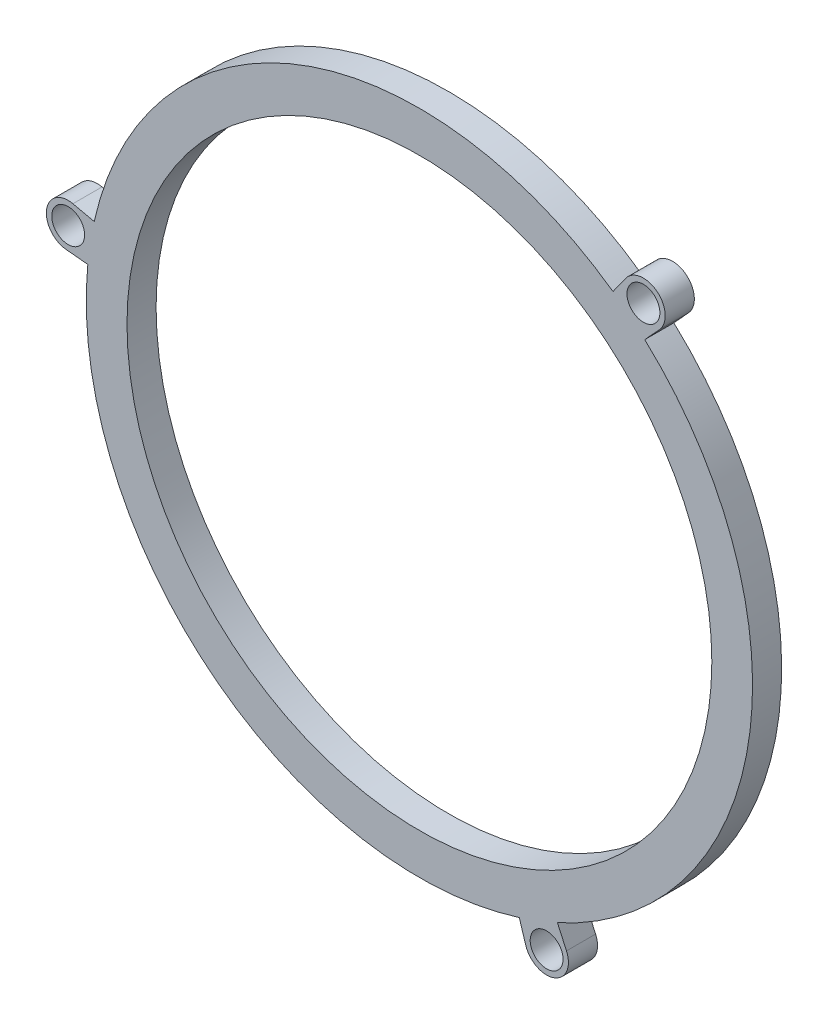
from build123d import *

# Parameters (mm, degrees)
SKETCH1_R      = 1.4351
SKETCH1_R_2    = 25.527
EXTRUDE1_DEPTH = 2.54


with BuildPart() as part:
    # Sketch1 → Extrude1 (new body)
    with BuildSketch(Plane.XY):
        with BuildLine():
            Line((-21.730297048, 15.9432569), (-19.834140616, 15.759910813))
            ThreePointArc((-19.834140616, 15.759910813), (-9.204773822, -9.627864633), (17.830867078, -14.785063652))
            Line((17.830867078, -14.785063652), (18.401850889, -16.602480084))
            ThreePointArc((18.401850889, -16.602480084), (20.900691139, -17.810452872), (21.953060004, -15.242200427))
            Line((21.953060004, -15.242200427), (21.163764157, -13.508407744))
            ThreePointArc((21.163764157, -13.508407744), (37.835539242, 8.390781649), (28.783984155, 34.382932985))
            Line((28.783984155, 34.382932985), (30.072421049, 35.786127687))
            ThreePointArc((30.072421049, 35.786127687), (29.869136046, 38.554173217), (27.118779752, 38.181425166))
            Line((27.118779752, 38.181425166), (26.011919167, 36.63097857))
            ThreePointArc((26.011919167, 36.63097857), (-1.289222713, 40.119564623), (-19.273308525, 19.284612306))
            Line((-19.273308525, 19.284612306), (-21.132729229, 19.698834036))
            ThreePointArc((-21.132729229, 19.698834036), (-23.428284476, 18.138761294), (-21.730297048, 15.9432569))
        make_face()
        with Locations((-21.54695096, 17.839413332)):
            Circle(SKETCH1_R, mode=Mode.SUBTRACT)
        with Locations((9.113847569, 12.960827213)):
            Circle(SKETCH1_R_2, mode=Mode.SUBTRACT)
        with Locations((28.669226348, 37.074564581)):
            Circle(SKETCH1_R, mode=Mode.SUBTRACT)
        with Locations((20.219267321, -16.031496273)):
            Circle(SKETCH1_R, mode=Mode.SUBTRACT)
    extrude(amount=EXTRUDE1_DEPTH)


solid = part.part
